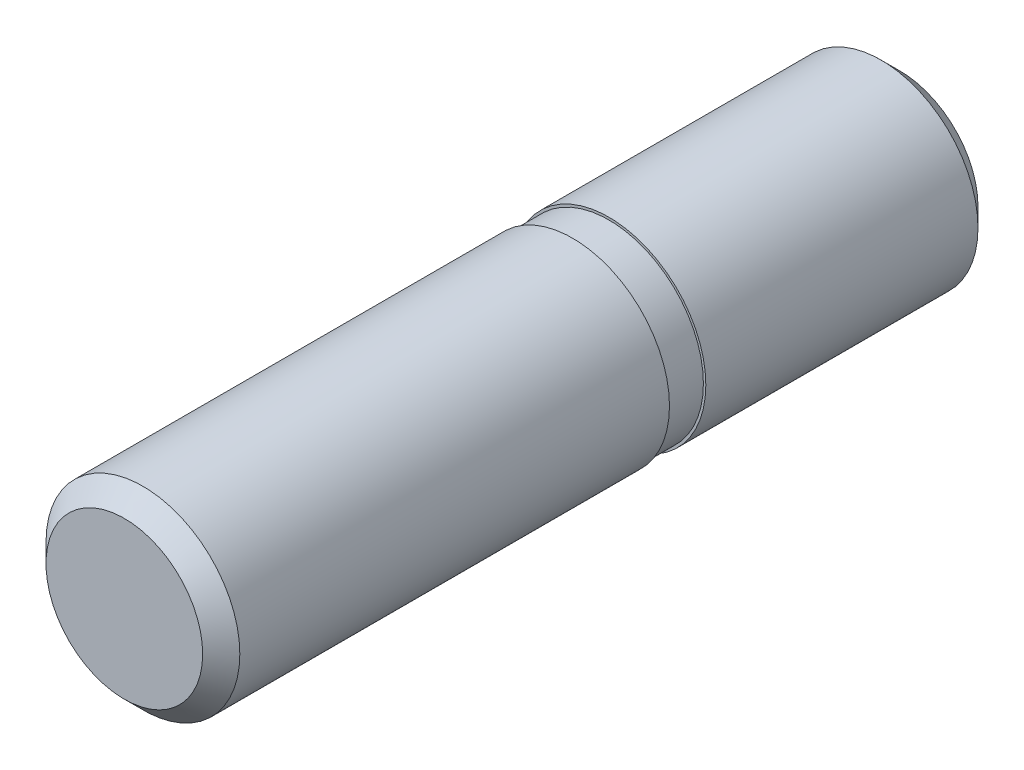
ISO-10303-21;
HEADER;
FILE_DESCRIPTION(('STEP AP214'),'2;1');
FILE_NAME('part.step','',(''),(''),'','','');
FILE_SCHEMA(('AUTOMOTIVE_DESIGN { 1 0 10303 214 1 1 1 1 }'));
ENDSEC;
DATA;
#1=APPLICATION_CONTEXT('core data for automotive mechanical design processes');
#2=APPLICATION_PROTOCOL_DEFINITION('international standard','automotive_design',2000,#1);
#3=PRODUCT_CONTEXT('',#1,'mechanical');
#4=PRODUCT('Part','Part','',(#3));
#5=PRODUCT_RELATED_PRODUCT_CATEGORY('part','',(#4));
#6=PRODUCT_DEFINITION_FORMATION('','',#4);
#7=PRODUCT_DEFINITION_CONTEXT('part definition',#1,'design');
#8=PRODUCT_DEFINITION('design','',#6,#7);
#9=PRODUCT_DEFINITION_SHAPE('','',#8);
#10=(LENGTH_UNIT() NAMED_UNIT(*) SI_UNIT(.MILLI.,.METRE.));
#11=(NAMED_UNIT(*) PLANE_ANGLE_UNIT() SI_UNIT($,.RADIAN.));
#12=(NAMED_UNIT(*) SI_UNIT($,.STERADIAN.) SOLID_ANGLE_UNIT());
#13=UNCERTAINTY_MEASURE_WITH_UNIT(LENGTH_MEASURE(1.E-05),#10,'distance_accuracy_value','');
#14=(GEOMETRIC_REPRESENTATION_CONTEXT(3) GLOBAL_UNCERTAINTY_ASSIGNED_CONTEXT((#13)) GLOBAL_UNIT_ASSIGNED_CONTEXT((#10,
#11,#12)) REPRESENTATION_CONTEXT('',''));
#15=CARTESIAN_POINT('',(0.,0.,0.));
#16=DIRECTION('',(0.,0.,1.));
#17=DIRECTION('',(1.,0.,0.));
#18=AXIS2_PLACEMENT_3D('',#15,#16,#17);
#19=CARTESIAN_POINT('',(0.,0.,4.75));
#20=DIRECTION('',(0.,0.,1.));
#21=DIRECTION('',(1.,0.,0.));
#22=AXIS2_PLACEMENT_3D('',#19,#20,#21);
#23=CYLINDRICAL_SURFACE('',#22,4.);
#24=CARTESIAN_POINT('',(0.,0.,19.233));
#25=DIRECTION('',(0.,0.,1.));
#26=DIRECTION('',(1.,0.,0.));
#27=AXIS2_PLACEMENT_3D('',#24,#25,#26);
#28=CIRCLE('',#27,4.);
#29=CARTESIAN_POINT('',(4.,0.,19.233));
#30=VERTEX_POINT('',#29);
#31=EDGE_CURVE('E18',#30,#30,#28,.F.);
#32=ORIENTED_EDGE('',*,*,#31,.T.);
#33=EDGE_LOOP('',(#32));
#34=FACE_BOUND('',#33,.T.);
#35=CARTESIAN_POINT('',(0.,0.,1.5));
#36=DIRECTION('',(0.,0.,1.));
#37=DIRECTION('',(1.,0.,0.));
#38=AXIS2_PLACEMENT_3D('',#35,#36,#37);
#39=CIRCLE('',#38,4.);
#40=CARTESIAN_POINT('',(4.,0.,1.5));
#41=VERTEX_POINT('',#40);
#42=EDGE_CURVE('E26',#41,#41,#39,.T.);
#43=ORIENTED_EDGE('',*,*,#42,.T.);
#44=EDGE_LOOP('',(#43));
#45=FACE_BOUND('',#44,.T.);
#46=ADVANCED_FACE('F12',(#34,#45),#23,.T.);
#47=CARTESIAN_POINT('',(0.,0.,1.5));
#48=DIRECTION('',(0.,0.,1.));
#49=DIRECTION('',(1.,0.,0.));
#50=AXIS2_PLACEMENT_3D('',#47,#48,#49);
#51=PLANE('',#50);
#52=CARTESIAN_POINT('',(0.,0.,1.5));
#53=DIRECTION('',(0.,0.,-1.));
#54=DIRECTION('',(-1.,0.,0.));
#55=AXIS2_PLACEMENT_3D('',#52,#53,#54);
#56=CIRCLE('',#55,3.9);
#57=CARTESIAN_POINT('',(-3.9,0.,1.5));
#58=VERTEX_POINT('',#57);
#59=EDGE_CURVE('E33',#58,#58,#56,.T.);
#60=ORIENTED_EDGE('',*,*,#59,.F.);
#61=EDGE_LOOP('',(#60));
#62=FACE_BOUND('',#61,.T.);
#63=ORIENTED_EDGE('',*,*,#42,.F.);
#64=EDGE_LOOP('',(#63));
#65=FACE_BOUND('',#64,.T.);
#66=ADVANCED_FACE('F46',(#62,#65),#51,.F.);
#67=CARTESIAN_POINT('',(0.,0.,20.));
#68=DIRECTION('',(0.,0.,1.));
#69=DIRECTION('',(1.,0.,0.));
#70=AXIS2_PLACEMENT_3D('',#67,#68,#69);
#71=PLANE('',#70);
#72=CARTESIAN_POINT('',(0.,0.,20.));
#73=DIRECTION('',(0.,0.,1.));
#74=DIRECTION('',(1.,0.,0.));
#75=AXIS2_PLACEMENT_3D('',#72,#73,#74);
#76=CIRCLE('',#75,3.233);
#77=CARTESIAN_POINT('',(3.233,0.,20.));
#78=VERTEX_POINT('',#77);
#79=EDGE_CURVE('E22',#78,#78,#76,.T.);
#80=ORIENTED_EDGE('',*,*,#79,.T.);
#81=EDGE_LOOP('',(#80));
#82=FACE_BOUND('',#81,.T.);
#83=ADVANCED_FACE('F49',(#82),#71,.T.);
#84=CARTESIAN_POINT('',(0.,0.,20.));
#85=DIRECTION('',(0.,0.,-1.));
#86=DIRECTION('',(-1.,0.,0.));
#87=AXIS2_PLACEMENT_3D('',#84,#85,#86);
#88=CONICAL_SURFACE('',#87,3.233,0.785398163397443);
#89=ORIENTED_EDGE('',*,*,#31,.F.);
#90=EDGE_LOOP('',(#89));
#91=FACE_BOUND('',#90,.T.);
#92=ORIENTED_EDGE('',*,*,#79,.F.);
#93=EDGE_LOOP('',(#92));
#94=FACE_BOUND('',#93,.T.);
#95=ADVANCED_FACE('F72',(#91,#94),#88,.T.);
#96=CARTESIAN_POINT('',(0.,0.,-2.21551528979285));
#97=DIRECTION('',(0.,0.,-1.));
#98=DIRECTION('',(-1.,0.,0.));
#99=AXIS2_PLACEMENT_3D('',#96,#97,#98);
#100=CYLINDRICAL_SURFACE('',#99,3.9);
#101=ORIENTED_EDGE('',*,*,#59,.T.);
#102=EDGE_LOOP('',(#101));
#103=FACE_BOUND('',#102,.T.);
#104=CARTESIAN_POINT('',(0.,0.,0.));
#105=DIRECTION('',(0.,0.,1.));
#106=DIRECTION('',(1.,0.,0.));
#107=AXIS2_PLACEMENT_3D('',#104,#105,#106);
#108=CIRCLE('',#107,3.9);
#109=CARTESIAN_POINT('',(3.9,0.,0.));
#110=VERTEX_POINT('',#109);
#111=EDGE_CURVE('E8',#110,#110,#108,.T.);
#112=ORIENTED_EDGE('',*,*,#111,.T.);
#113=EDGE_LOOP('',(#112));
#114=FACE_BOUND('',#113,.T.);
#115=ADVANCED_FACE('F44',(#103,#114),#100,.T.);
#116=CARTESIAN_POINT('',(0.,1.6165,-12.));
#117=DIRECTION('',(0.,0.,-1.));
#118=DIRECTION('',(-1.,0.,0.));
#119=AXIS2_PLACEMENT_3D('',#116,#117,#118);
#120=PLANE('',#119);
#121=CARTESIAN_POINT('',(0.,0.,-12.0000000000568));
#122=DIRECTION('',(0.,0.,1.));
#123=DIRECTION('',(1.,0.,0.));
#124=AXIS2_PLACEMENT_3D('',#121,#122,#123);
#125=CIRCLE('',#124,3.23300000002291);
#126=CARTESIAN_POINT('',(3.23300000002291,0.,-12.0000000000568));
#127=VERTEX_POINT('',#126);
#128=EDGE_CURVE('E29',#127,#127,#125,.T.);
#129=ORIENTED_EDGE('',*,*,#128,.F.);
#130=EDGE_LOOP('',(#129));
#131=FACE_BOUND('',#130,.T.);
#132=ADVANCED_FACE('F89',(#131),#120,.T.);
#133=CARTESIAN_POINT('',(0.,0.,-11.2330000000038));
#134=DIRECTION('',(0.,0.,1.));
#135=DIRECTION('',(1.,0.,0.));
#136=AXIS2_PLACEMENT_3D('',#133,#134,#135);
#137=CONICAL_SURFACE('',#136,4.00000000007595,0.785398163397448);
#138=CARTESIAN_POINT('',(0.,0.,-11.233));
#139=DIRECTION('',(0.,0.,1.));
#140=DIRECTION('',(1.,0.,0.));
#141=AXIS2_PLACEMENT_3D('',#138,#139,#140);
#142=CIRCLE('',#141,4.);
#143=CARTESIAN_POINT('',(4.,0.,-11.233));
#144=VERTEX_POINT('',#143);
#145=EDGE_CURVE('E32',#144,#144,#142,.T.);
#146=ORIENTED_EDGE('',*,*,#145,.F.);
#147=EDGE_LOOP('',(#146));
#148=FACE_BOUND('',#147,.T.);
#149=ORIENTED_EDGE('',*,*,#128,.T.);
#150=EDGE_LOOP('',(#149));
#151=FACE_BOUND('',#150,.T.);
#152=ADVANCED_FACE('F97',(#148,#151),#137,.T.);
#153=CARTESIAN_POINT('',(0.,0.,4.75));
#154=DIRECTION('',(0.,0.,1.));
#155=DIRECTION('',(1.,0.,0.));
#156=AXIS2_PLACEMENT_3D('',#153,#154,#155);
#157=CYLINDRICAL_SURFACE('',#156,4.);
#158=CARTESIAN_POINT('',(0.,0.,0.));
#159=DIRECTION('',(0.,0.,1.));
#160=DIRECTION('',(1.,0.,0.));
#161=AXIS2_PLACEMENT_3D('',#158,#159,#160);
#162=CIRCLE('',#161,4.);
#163=CARTESIAN_POINT('',(4.,0.,0.));
#164=VERTEX_POINT('',#163);
#165=EDGE_CURVE('E34',#164,#164,#162,.T.);
#166=ORIENTED_EDGE('',*,*,#165,.F.);
#167=EDGE_LOOP('',(#166));
#168=FACE_BOUND('',#167,.T.);
#169=ORIENTED_EDGE('',*,*,#145,.T.);
#170=EDGE_LOOP('',(#169));
#171=FACE_BOUND('',#170,.T.);
#172=ADVANCED_FACE('F106',(#168,#171),#157,.T.);
#173=CARTESIAN_POINT('',(0.,0.,0.));
#174=DIRECTION('',(0.,0.,1.));
#175=DIRECTION('',(1.,0.,0.));
#176=AXIS2_PLACEMENT_3D('',#173,#174,#175);
#177=PLANE('',#176);
#178=ORIENTED_EDGE('',*,*,#111,.F.);
#179=EDGE_LOOP('',(#178));
#180=FACE_BOUND('',#179,.T.);
#181=ORIENTED_EDGE('',*,*,#165,.T.);
#182=EDGE_LOOP('',(#181));
#183=FACE_BOUND('',#182,.T.);
#184=ADVANCED_FACE('F115',(#180,#183),#177,.T.);
#185=CLOSED_SHELL('',(#46,#66,#83,#95,#115,#132,#152,#172,#184));
#186=MANIFOLD_SOLID_BREP('B1',#185);
#187=ADVANCED_BREP_SHAPE_REPRESENTATION('',(#18,#186),#14);
#188=SHAPE_DEFINITION_REPRESENTATION(#9,#187);
ENDSEC;
END-ISO-10303-21;
